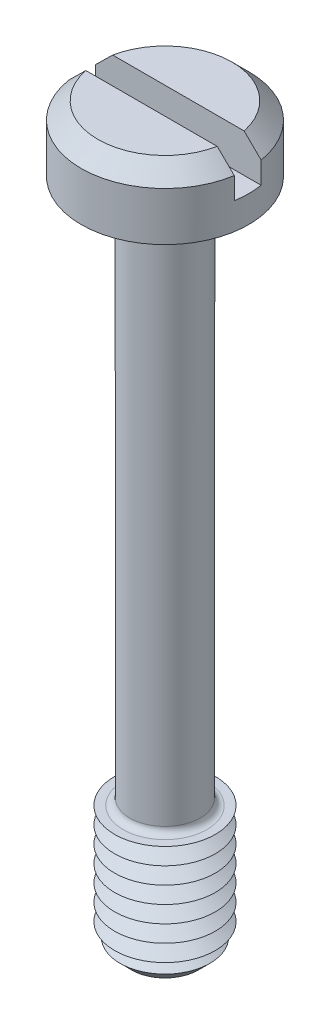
ISO-10303-21;
HEADER;
FILE_DESCRIPTION(('STEP AP214'),'2;1');
FILE_NAME('part.step','',(''),(''),'','','');
FILE_SCHEMA(('AUTOMOTIVE_DESIGN { 1 0 10303 214 1 1 1 1 }'));
ENDSEC;
DATA;
#1=APPLICATION_CONTEXT('core data for automotive mechanical design processes');
#2=APPLICATION_PROTOCOL_DEFINITION('international standard','automotive_design',2000,#1);
#3=PRODUCT_CONTEXT('',#1,'mechanical');
#4=PRODUCT('Part','Part','',(#3));
#5=PRODUCT_RELATED_PRODUCT_CATEGORY('part','',(#4));
#6=PRODUCT_DEFINITION_FORMATION('','',#4);
#7=PRODUCT_DEFINITION_CONTEXT('part definition',#1,'design');
#8=PRODUCT_DEFINITION('design','',#6,#7);
#9=PRODUCT_DEFINITION_SHAPE('','',#8);
#10=(LENGTH_UNIT() NAMED_UNIT(*) SI_UNIT(.MILLI.,.METRE.));
#11=(NAMED_UNIT(*) PLANE_ANGLE_UNIT() SI_UNIT($,.RADIAN.));
#12=(NAMED_UNIT(*) SI_UNIT($,.STERADIAN.) SOLID_ANGLE_UNIT());
#13=UNCERTAINTY_MEASURE_WITH_UNIT(LENGTH_MEASURE(1.E-05),#10,'distance_accuracy_value','');
#14=(GEOMETRIC_REPRESENTATION_CONTEXT(3) GLOBAL_UNCERTAINTY_ASSIGNED_CONTEXT((#13)) GLOBAL_UNIT_ASSIGNED_CONTEXT((#10,
#11,#12)) REPRESENTATION_CONTEXT('',''));
#15=CARTESIAN_POINT('',(0.,0.,0.));
#16=DIRECTION('',(0.,0.,1.));
#17=DIRECTION('',(1.,0.,0.));
#18=AXIS2_PLACEMENT_3D('',#15,#16,#17);
#19=CARTESIAN_POINT('',(0.,3.9,0.));
#20=DIRECTION('',(0.,1.,0.));
#21=DIRECTION('',(0.,0.,1.));
#22=AXIS2_PLACEMENT_3D('',#19,#20,#21);
#23=PLANE('',#22);
#24=DIRECTION('',(-1.,0.,0.));
#25=VECTOR('',#24,1.);
#26=CARTESIAN_POINT('',(5.,3.9,-0.8));
#27=LINE('',#26,#25);
#28=CARTESIAN_POINT('',(3.91918358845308,3.9,-0.8));
#29=VERTEX_POINT('',#28);
#30=CARTESIAN_POINT('',(-3.91918358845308,3.9,-0.8));
#31=VERTEX_POINT('',#30);
#32=EDGE_CURVE('E110',#29,#31,#27,.T.);
#33=ORIENTED_EDGE('',*,*,#32,.F.);
#34=CARTESIAN_POINT('',(0.,3.9,0.));
#35=DIRECTION('',(0.,1.,0.));
#36=DIRECTION('',(0.,0.,1.));
#37=AXIS2_PLACEMENT_3D('',#34,#35,#36);
#38=CIRCLE('',#37,4.);
#39=EDGE_CURVE('E113',#29,#31,#38,.T.);
#40=ORIENTED_EDGE('',*,*,#39,.T.);
#41=EDGE_LOOP('',(#33,#40));
#42=FACE_BOUND('',#41,.T.);
#43=ADVANCED_FACE('F39',(#42),#23,.T.);
#44=CARTESIAN_POINT('',(0.,3.9,0.));
#45=DIRECTION('',(0.,-1.,0.));
#46=DIRECTION('',(0.,0.,-1.));
#47=AXIS2_PLACEMENT_3D('',#44,#45,#46);
#48=CONICAL_SURFACE('',#47,4.,0.785398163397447);
#49=CARTESIAN_POINT('',(11.0010756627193,-3.13012537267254,-0.8));
#50=CARTESIAN_POINT('',(10.6180645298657,-2.74813121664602,-0.8));
#51=CARTESIAN_POINT('',(10.2350087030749,-2.36618183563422,-0.8));
#52=CARTESIAN_POINT('',(9.46873746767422,-1.60241986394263,-0.8));
#53=CARTESIAN_POINT('',(9.08552205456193,-1.2206072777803,-0.8));
#54=CARTESIAN_POINT('',(8.31861292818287,-0.456918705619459,-0.8));
#55=CARTESIAN_POINT('',(7.93491906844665,-0.0750428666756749,-0.8));
#56=CARTESIAN_POINT('',(7.16722555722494,0.688378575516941,-0.8));
#57=CARTESIAN_POINT('',(6.78322591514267,1.06992418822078,-0.8));
#58=CARTESIAN_POINT('',(6.01856215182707,1.82868912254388,-0.8));
#59=CARTESIAN_POINT('',(5.63790309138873,2.20591354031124,-0.8));
#60=CARTESIAN_POINT('',(5.06622054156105,2.77108317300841,-0.8));
#61=CARTESIAN_POINT('',(4.87553531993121,2.9593704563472,-0.8));
#62=CARTESIAN_POINT('',(4.49384424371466,3.33561647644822,-0.8));
#63=CARTESIAN_POINT('',(4.302838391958,3.52357521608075,-0.8));
#64=CARTESIAN_POINT('',(3.92044271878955,3.89893397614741,-0.8));
#65=CARTESIAN_POINT('',(3.7290531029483,4.08633420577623,-0.8));
#66=CARTESIAN_POINT('',(3.34554223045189,4.46039762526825,-0.8));
#67=CARTESIAN_POINT('',(3.15342094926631,4.64706078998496,-0.8));
#68=CARTESIAN_POINT('',(2.76802565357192,5.01913697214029,-0.8));
#69=CARTESIAN_POINT('',(2.57475182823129,5.2045501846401,-0.8));
#70=CARTESIAN_POINT('',(2.28318236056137,5.48091108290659,-0.8));
#71=CARTESIAN_POINT('',(2.1857187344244,5.57273577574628,-0.8));
#72=CARTESIAN_POINT('',(1.98998431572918,5.75552004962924,-0.8));
#73=CARTESIAN_POINT('',(1.89171354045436,5.84647964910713,-0.8));
#74=CARTESIAN_POINT('',(1.76578543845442,5.96147491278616,-0.8));
#75=CARTESIAN_POINT('',(1.73869031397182,5.98612635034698,-0.8));
#76=CARTESIAN_POINT('',(1.68439529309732,6.03531372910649,-0.8));
#77=CARTESIAN_POINT('',(1.65719539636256,6.05984966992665,-0.8));
#78=CARTESIAN_POINT('',(1.5754162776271,6.13326356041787,-0.8));
#79=CARTESIAN_POINT('',(1.52066027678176,6.18194515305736,-0.8));
#80=CARTESIAN_POINT('',(1.41038257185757,6.27874171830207,-0.8));
#81=CARTESIAN_POINT('',(1.35485918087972,6.32685477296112,-0.8));
#82=CARTESIAN_POINT('',(1.24299231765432,6.42210730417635,-0.8));
#83=CARTESIAN_POINT('',(1.18664895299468,6.46924690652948,-0.8));
#84=CARTESIAN_POINT('',(1.07845249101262,6.55754663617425,-0.8));
#85=CARTESIAN_POINT('',(1.02670624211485,6.59883713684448,-0.8));
#86=CARTESIAN_POINT('',(0.921961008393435,6.67979338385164,-0.8));
#87=CARTESIAN_POINT('',(0.868962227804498,6.71945939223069,-0.8));
#88=CARTESIAN_POINT('',(0.761295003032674,6.79630361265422,-0.8));
#89=CARTESIAN_POINT('',(0.706629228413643,6.83348552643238,-0.8));
#90=CARTESIAN_POINT('',(0.594896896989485,6.90399895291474,-0.8));
#91=CARTESIAN_POINT('',(0.537833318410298,6.9373350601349,-0.8));
#92=CARTESIAN_POINT('',(0.428390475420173,6.99356340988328,-0.8));
#93=CARTESIAN_POINT('',(0.376435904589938,7.01726022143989,-0.8));
#94=CARTESIAN_POINT('',(0.269759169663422,7.05717670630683,-0.8));
#95=CARTESIAN_POINT('',(0.21504674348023,7.07342088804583,-0.8));
#96=CARTESIAN_POINT('',(0.113016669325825,7.09332110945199,-0.8));
#97=CARTESIAN_POINT('',(0.0660435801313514,7.09866042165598,-0.8));
#98=CARTESIAN_POINT('',(-0.0280587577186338,7.10088875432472,-0.8));
#99=CARTESIAN_POINT('',(-0.075187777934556,7.09778705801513,-0.8));
#100=CARTESIAN_POINT('',(-0.180723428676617,7.08192474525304,-0.8));
#101=CARTESIAN_POINT('',(-0.238762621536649,7.06679554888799,-0.8));
#102=CARTESIAN_POINT('',(-0.323499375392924,7.03748409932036,-0.8));
#103=CARTESIAN_POINT('',(-0.351441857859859,7.02656594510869,-0.8));
#104=CARTESIAN_POINT('',(-0.406569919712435,7.00295901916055,-0.8));
#105=CARTESIAN_POINT('',(-0.433755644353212,6.99027059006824,-0.8));
#106=CARTESIAN_POINT('',(-0.504673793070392,6.95489235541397,-0.8));
#107=CARTESIAN_POINT('',(-0.547808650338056,6.93101671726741,-0.8));
#108=CARTESIAN_POINT('',(-0.632566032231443,6.88069648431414,-0.8));
#109=CARTESIAN_POINT('',(-0.674187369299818,6.85424992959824,-0.8));
#110=CARTESIAN_POINT('',(-0.756326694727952,6.79950439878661,-0.8));
#111=CARTESIAN_POINT('',(-0.796841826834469,6.77120117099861,-0.8));
#112=CARTESIAN_POINT('',(-0.876938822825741,6.71329852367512,-0.8));
#113=CARTESIAN_POINT('',(-0.916520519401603,6.68369887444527,-0.8));
#114=CARTESIAN_POINT('',(-1.03465904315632,6.59312324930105,-0.8));
#115=CARTESIAN_POINT('',(-1.11211338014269,6.53071425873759,-0.8));
#116=CARTESIAN_POINT('',(-1.26505454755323,6.40381418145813,-0.8));
#117=CARTESIAN_POINT('',(-1.34054439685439,6.33932667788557,-0.8));
#118=CARTESIAN_POINT('',(-1.48913173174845,6.20997083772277,-0.8));
#119=CARTESIAN_POINT('',(-1.56224816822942,6.14512422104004,-0.8));
#120=CARTESIAN_POINT('',(-1.70765393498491,6.01451044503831,-0.8));
#121=CARTESIAN_POINT('',(-1.77994324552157,5.94874326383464,-0.8));
#122=CARTESIAN_POINT('',(-1.99594639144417,5.75046596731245,-0.8));
#123=CARTESIAN_POINT('',(-2.13877767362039,5.6169958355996,-0.8));
#124=CARTESIAN_POINT('',(-2.42324632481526,5.34853800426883,-0.8));
#125=CARTESIAN_POINT('',(-2.56488247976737,5.2135490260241,-0.8));
#126=CARTESIAN_POINT('',(-2.84730929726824,4.94270932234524,-0.8));
#127=CARTESIAN_POINT('',(-2.98810001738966,4.80685865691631,-0.8));
#128=CARTESIAN_POINT('',(-3.26818763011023,4.53549974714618,-0.8));
#129=CARTESIAN_POINT('',(-3.40748821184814,4.39999530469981,-0.8));
#130=CARTESIAN_POINT('',(-3.68570899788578,4.12859172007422,-0.8));
#131=CARTESIAN_POINT('',(-3.82462919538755,3.99269257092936,-0.8));
#132=CARTESIAN_POINT('',(-4.24087543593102,3.58468153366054,-0.8));
#133=CARTESIAN_POINT('',(-4.51779300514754,3.31215310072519,-0.8));
#134=CARTESIAN_POINT('',(-5.05279381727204,2.7844393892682,-0.8));
#135=CARTESIAN_POINT('',(-5.31091639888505,2.52929393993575,-0.8));
#136=CARTESIAN_POINT('',(-5.82680751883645,2.01864429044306,-0.8));
#137=CARTESIAN_POINT('',(-6.08457605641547,1.76314008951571,-0.8));
#138=CARTESIAN_POINT('',(-6.85760508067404,0.996194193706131,-0.8));
#139=CARTESIAN_POINT('',(-7.37251152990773,0.48439576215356,-0.8));
#140=CARTESIAN_POINT('',(-8.40657233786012,-0.544392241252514,-0.8));
#141=CARTESIAN_POINT('',(-8.92572224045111,-1.06138628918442,-0.8));
#142=CARTESIAN_POINT('',(-9.96362871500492,-2.09560660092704,-0.8));
#143=CARTESIAN_POINT('',(-10.4823853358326,-2.61283281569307,-0.8));
#144=CARTESIAN_POINT('',(-11.0010756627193,-3.13012537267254,-0.8));
#145=B_SPLINE_CURVE_WITH_KNOTS('',3,(#49,#50,#51,#52,#53,#54,#55,#56,#57,#58,#59,#60,#61,#62,
#63,#64,#65,#66,#67,#68,#69,#70,#71,#72,#73,#74,#75,#76,#77,#78,#79,#80,#81,#82,#83,#84,#85,#86,
#87,#88,#89,#90,#91,#92,#93,#94,#95,#96,#97,#98,#99,#100,#101,#102,#103,#104,#105,#106,#107,
#108,#109,#110,#111,#112,#113,#114,#115,#116,#117,#118,#119,#120,#121,#122,#123,#124,#125,#126,
#127,#128,#129,#130,#131,#132,#133,#134,#135,#136,#137,#138,#139,#140,#141,#142,#143,#144),
.UNSPECIFIED.,.F.,.F.,(4,2,2,2,2,2,2,2,2,2,2,2,2,2,2,2,2,2,2,2,2,2,2,2,2,2,2,2,2,2,2,2,2,2,2,2,
2,2,2,2,2,2,2,2,2,2,2,4),(0.,1.62282275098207,3.24569489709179,4.86971791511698,
6.49369278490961,8.10142191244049,8.90535980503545,9.70929063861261,10.5128682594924,
11.3164730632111,12.1199494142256,12.5216659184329,12.9233738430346,13.0332669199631,
13.1431603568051,13.3629580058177,13.5833578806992,13.8037290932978,14.0023112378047,
14.2008612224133,14.3991084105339,14.5971162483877,14.7680800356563,14.9384774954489,
15.0795987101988,15.2205647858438,15.3993585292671,15.4893211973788,15.5792664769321,
15.727032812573,15.8749126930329,16.0231439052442,16.1714014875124,16.4697244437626,
16.7675580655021,17.0607348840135,17.3539186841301,17.9403574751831,18.5273336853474,
19.1142694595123,19.6972736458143,20.280288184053,21.4458742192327,22.5346981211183,
23.6235243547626,25.8015035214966,27.9995014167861,30.1971550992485),.UNSPECIFIED.);
#146=CARTESIAN_POINT('',(4.93558507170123,2.89999999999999,-0.8));
#147=VERTEX_POINT('',#146);
#148=EDGE_CURVE('E252',#147,#29,#145,.T.);
#149=ORIENTED_EDGE('',*,*,#148,.F.);
#150=CARTESIAN_POINT('',(0.,2.89999999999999,0.));
#151=DIRECTION('',(0.,1.,0.));
#152=DIRECTION('',(0.,0.,1.));
#153=AXIS2_PLACEMENT_3D('',#150,#151,#152);
#154=CIRCLE('',#153,5.);
#155=CARTESIAN_POINT('',(-4.93558507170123,2.89999999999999,-0.8));
#156=VERTEX_POINT('',#155);
#157=EDGE_CURVE('E128',#156,#147,#154,.F.);
#158=ORIENTED_EDGE('',*,*,#157,.F.);
#159=EDGE_CURVE('E102',#31,#156,#145,.T.);
#160=ORIENTED_EDGE('',*,*,#159,.F.);
#161=ORIENTED_EDGE('',*,*,#39,.F.);
#162=EDGE_LOOP('',(#149,#158,#160,#161));
#163=FACE_BOUND('',#162,.T.);
#164=ADVANCED_FACE('F214',(#163),#48,.T.);
#165=CARTESIAN_POINT('',(0.,-40.,0.));
#166=DIRECTION('',(0.,1.,0.));
#167=DIRECTION('',(0.,0.,1.));
#168=AXIS2_PLACEMENT_3D('',#165,#166,#167);
#169=CYLINDRICAL_SURFACE('',#168,2.1);
#170=CARTESIAN_POINT('',(0.,-32.1,0.));
#171=DIRECTION('',(0.,-1.,0.));
#172=DIRECTION('',(0.,0.,-1.));
#173=AXIS2_PLACEMENT_3D('',#170,#171,#172);
#174=CIRCLE('',#173,2.1);
#175=CARTESIAN_POINT('',(0.,-32.1,-2.1));
#176=VERTEX_POINT('',#175);
#177=EDGE_CURVE('E123',#176,#176,#174,.F.);
#178=ORIENTED_EDGE('',*,*,#177,.T.);
#179=EDGE_LOOP('',(#178));
#180=FACE_BOUND('',#179,.T.);
#181=CARTESIAN_POINT('',(0.,-0.399999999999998,0.));
#182=DIRECTION('',(0.,1.,0.));
#183=DIRECTION('',(0.,0.,1.));
#184=AXIS2_PLACEMENT_3D('',#181,#182,#183);
#185=CIRCLE('',#184,2.1);
#186=CARTESIAN_POINT('',(0.,-0.399999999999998,2.1));
#187=VERTEX_POINT('',#186);
#188=EDGE_CURVE('E349',#187,#187,#185,.F.);
#189=ORIENTED_EDGE('',*,*,#188,.T.);
#190=EDGE_LOOP('',(#189));
#191=FACE_BOUND('',#190,.T.);
#192=ADVANCED_FACE('F210',(#180,#191),#169,.T.);
#193=CARTESIAN_POINT('',(0.,3.9,0.));
#194=DIRECTION('',(0.,-1.,0.));
#195=DIRECTION('',(0.,0.,-1.));
#196=AXIS2_PLACEMENT_3D('',#193,#194,#195);
#197=CYLINDRICAL_SURFACE('',#196,5.);
#198=ORIENTED_EDGE('',*,*,#157,.T.);
#199=DIRECTION('',(0.,-1.,0.));
#200=VECTOR('',#199,1.);
#201=CARTESIAN_POINT('',(4.93558507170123,3.9,-0.8));
#202=LINE('',#201,#200);
#203=CARTESIAN_POINT('',(4.93558507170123,1.6,-0.8));
#204=VERTEX_POINT('',#203);
#205=EDGE_CURVE('E64',#147,#204,#202,.T.);
#206=ORIENTED_EDGE('',*,*,#205,.T.);
#207=CARTESIAN_POINT('',(0.,1.6,0.));
#208=DIRECTION('',(0.,1.,0.));
#209=DIRECTION('',(0.,0.,1.));
#210=AXIS2_PLACEMENT_3D('',#207,#208,#209);
#211=CIRCLE('',#210,5.);
#212=CARTESIAN_POINT('',(4.93558507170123,1.6,0.8));
#213=VERTEX_POINT('',#212);
#214=EDGE_CURVE('E11',#213,#204,#211,.T.);
#215=ORIENTED_EDGE('',*,*,#214,.F.);
#216=DIRECTION('',(0.,-1.,0.));
#217=VECTOR('',#216,1.);
#218=CARTESIAN_POINT('',(4.93558507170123,3.9,0.8));
#219=LINE('',#218,#217);
#220=CARTESIAN_POINT('',(4.93558507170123,2.89999999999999,0.8));
#221=VERTEX_POINT('',#220);
#222=EDGE_CURVE('E267',#213,#221,#219,.F.);
#223=ORIENTED_EDGE('',*,*,#222,.T.);
#224=CARTESIAN_POINT('',(-4.93558507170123,2.89999999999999,0.8));
#225=VERTEX_POINT('',#224);
#226=EDGE_CURVE('E120',#221,#225,#154,.F.);
#227=ORIENTED_EDGE('',*,*,#226,.T.);
#228=DIRECTION('',(0.,-1.,0.));
#229=VECTOR('',#228,1.);
#230=CARTESIAN_POINT('',(-4.93558507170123,3.9,0.8));
#231=LINE('',#230,#229);
#232=CARTESIAN_POINT('',(-4.93558507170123,1.6,0.8));
#233=VERTEX_POINT('',#232);
#234=EDGE_CURVE('E96',#225,#233,#231,.T.);
#235=ORIENTED_EDGE('',*,*,#234,.T.);
#236=CARTESIAN_POINT('',(-4.93558507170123,1.6,-0.8));
#237=VERTEX_POINT('',#236);
#238=EDGE_CURVE('E44',#237,#233,#211,.T.);
#239=ORIENTED_EDGE('',*,*,#238,.F.);
#240=DIRECTION('',(0.,-1.,0.));
#241=VECTOR('',#240,1.);
#242=CARTESIAN_POINT('',(-4.93558507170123,3.9,-0.8));
#243=LINE('',#242,#241);
#244=EDGE_CURVE('E272',#237,#156,#243,.F.);
#245=ORIENTED_EDGE('',*,*,#244,.T.);
#246=EDGE_LOOP('',(#198,#206,#215,#223,#227,#235,#239,#245));
#247=FACE_BOUND('',#246,.T.);
#248=CARTESIAN_POINT('',(0.,0.,0.));
#249=DIRECTION('',(0.,1.,0.));
#250=DIRECTION('',(0.,0.,1.));
#251=AXIS2_PLACEMENT_3D('',#248,#249,#250);
#252=CIRCLE('',#251,5.);
#253=CARTESIAN_POINT('',(0.,0.,5.));
#254=VERTEX_POINT('',#253);
#255=EDGE_CURVE('E334',#254,#254,#252,.T.);
#256=ORIENTED_EDGE('',*,*,#255,.T.);
#257=EDGE_LOOP('',(#256));
#258=FACE_BOUND('',#257,.T.);
#259=ADVANCED_FACE('F213',(#247,#258),#197,.T.);
#260=DIRECTION('',(1.,0.,0.));
#261=VECTOR('',#260,1.);
#262=CARTESIAN_POINT('',(5.,3.9,0.8));
#263=LINE('',#262,#261);
#264=CARTESIAN_POINT('',(-3.91918358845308,3.9,0.8));
#265=VERTEX_POINT('',#264);
#266=CARTESIAN_POINT('',(3.91918358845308,3.9,0.8));
#267=VERTEX_POINT('',#266);
#268=EDGE_CURVE('E56',#265,#267,#263,.T.);
#269=ORIENTED_EDGE('',*,*,#268,.F.);
#270=EDGE_CURVE('E108',#265,#267,#38,.T.);
#271=ORIENTED_EDGE('',*,*,#270,.T.);
#272=EDGE_LOOP('',(#269,#271));
#273=FACE_BOUND('',#272,.T.);
#274=ADVANCED_FACE('F107',(#273),#23,.T.);
#275=CARTESIAN_POINT('',(0.,0.,0.));
#276=DIRECTION('',(0.,1.,0.));
#277=DIRECTION('',(0.,0.,1.));
#278=AXIS2_PLACEMENT_3D('',#275,#276,#277);
#279=PLANE('',#278);
#280=CARTESIAN_POINT('',(0.,0.,0.));
#281=DIRECTION('',(0.,1.,0.));
#282=DIRECTION('',(0.,0.,1.));
#283=AXIS2_PLACEMENT_3D('',#280,#281,#282);
#284=CIRCLE('',#283,2.5);
#285=CARTESIAN_POINT('',(0.,0.,2.5));
#286=VERTEX_POINT('',#285);
#287=EDGE_CURVE('E114',#286,#286,#284,.T.);
#288=ORIENTED_EDGE('',*,*,#287,.T.);
#289=EDGE_LOOP('',(#288));
#290=FACE_BOUND('',#289,.T.);
#291=ORIENTED_EDGE('',*,*,#255,.F.);
#292=EDGE_LOOP('',(#291));
#293=FACE_BOUND('',#292,.T.);
#294=ADVANCED_FACE('F204',(#290,#293),#279,.F.);
#295=CARTESIAN_POINT('',(0.,-32.5,0.));
#296=DIRECTION('',(0.,-1.,0.));
#297=DIRECTION('',(0.,0.,-1.));
#298=AXIS2_PLACEMENT_3D('',#295,#296,#297);
#299=PLANE('',#298);
#300=CARTESIAN_POINT('',(0.,-32.5,0.));
#301=DIRECTION('',(0.,-1.,0.));
#302=DIRECTION('',(0.,0.,-1.));
#303=AXIS2_PLACEMENT_3D('',#300,#301,#302);
#304=CIRCLE('',#303,2.5);
#305=CARTESIAN_POINT('',(0.,-32.5,-2.5));
#306=VERTEX_POINT('',#305);
#307=EDGE_CURVE('E342',#306,#306,#304,.T.);
#308=ORIENTED_EDGE('',*,*,#307,.T.);
#309=EDGE_LOOP('',(#308));
#310=FACE_BOUND('',#309,.T.);
#311=CARTESIAN_POINT('',(0.,-32.5,0.));
#312=DIRECTION('',(0.,1.,0.));
#313=DIRECTION('',(0.,0.,1.));
#314=AXIS2_PLACEMENT_3D('',#311,#312,#313);
#315=CIRCLE('',#314,3.);
#316=CARTESIAN_POINT('',(0.,-32.5,3.));
#317=VERTEX_POINT('',#316);
#318=EDGE_CURVE('E330',#317,#317,#315,.T.);
#319=ORIENTED_EDGE('',*,*,#318,.T.);
#320=EDGE_LOOP('',(#319));
#321=FACE_BOUND('',#320,.T.);
#322=ADVANCED_FACE('F200',(#310,#321),#299,.F.);
#323=CARTESIAN_POINT('',(0.,-33.,0.));
#324=DIRECTION('',(0.,1.,0.));
#325=DIRECTION('',(0.,0.,1.));
#326=AXIS2_PLACEMENT_3D('',#323,#324,#325);
#327=CONICAL_SURFACE('',#326,2.13397459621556,1.0471975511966);
#328=ORIENTED_EDGE('',*,*,#318,.F.);
#329=EDGE_LOOP('',(#328));
#330=FACE_BOUND('',#329,.T.);
#331=CARTESIAN_POINT('',(0.,-33.,0.));
#332=DIRECTION('',(0.,1.,0.));
#333=DIRECTION('',(0.,0.,1.));
#334=AXIS2_PLACEMENT_3D('',#331,#332,#333);
#335=CIRCLE('',#334,2.13397459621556);
#336=CARTESIAN_POINT('',(0.,-33.,2.13397459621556));
#337=VERTEX_POINT('',#336);
#338=EDGE_CURVE('E326',#337,#337,#335,.T.);
#339=ORIENTED_EDGE('',*,*,#338,.T.);
#340=EDGE_LOOP('',(#339));
#341=FACE_BOUND('',#340,.T.);
#342=ADVANCED_FACE('F196',(#330,#341),#327,.T.);
#343=CARTESIAN_POINT('',(0.,-33.5,0.));
#344=DIRECTION('',(0.,-1.,0.));
#345=DIRECTION('',(0.,0.,-1.));
#346=AXIS2_PLACEMENT_3D('',#343,#344,#345);
#347=CONICAL_SURFACE('',#346,3.,1.0471975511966);
#348=ORIENTED_EDGE('',*,*,#338,.F.);
#349=EDGE_LOOP('',(#348));
#350=FACE_BOUND('',#349,.T.);
#351=CARTESIAN_POINT('',(0.,-33.5,0.));
#352=DIRECTION('',(0.,1.,0.));
#353=DIRECTION('',(0.,0.,1.));
#354=AXIS2_PLACEMENT_3D('',#351,#352,#353);
#355=CIRCLE('',#354,3.);
#356=CARTESIAN_POINT('',(0.,-33.5,3.));
#357=VERTEX_POINT('',#356);
#358=EDGE_CURVE('E322',#357,#357,#355,.T.);
#359=ORIENTED_EDGE('',*,*,#358,.T.);
#360=EDGE_LOOP('',(#359));
#361=FACE_BOUND('',#360,.T.);
#362=ADVANCED_FACE('F192',(#350,#361),#347,.T.);
#363=CARTESIAN_POINT('',(0.,-34.,0.));
#364=DIRECTION('',(0.,1.,0.));
#365=DIRECTION('',(0.,0.,1.));
#366=AXIS2_PLACEMENT_3D('',#363,#364,#365);
#367=CONICAL_SURFACE('',#366,2.13397459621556,1.0471975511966);
#368=ORIENTED_EDGE('',*,*,#358,.F.);
#369=EDGE_LOOP('',(#368));
#370=FACE_BOUND('',#369,.T.);
#371=CARTESIAN_POINT('',(0.,-34.,0.));
#372=DIRECTION('',(0.,1.,0.));
#373=DIRECTION('',(0.,0.,1.));
#374=AXIS2_PLACEMENT_3D('',#371,#372,#373);
#375=CIRCLE('',#374,2.13397459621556);
#376=CARTESIAN_POINT('',(0.,-34.,2.13397459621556));
#377=VERTEX_POINT('',#376);
#378=EDGE_CURVE('E318',#377,#377,#375,.T.);
#379=ORIENTED_EDGE('',*,*,#378,.T.);
#380=EDGE_LOOP('',(#379));
#381=FACE_BOUND('',#380,.T.);
#382=ADVANCED_FACE('F188',(#370,#381),#367,.T.);
#383=CARTESIAN_POINT('',(0.,-34.5,0.));
#384=DIRECTION('',(0.,-1.,0.));
#385=DIRECTION('',(0.,0.,-1.));
#386=AXIS2_PLACEMENT_3D('',#383,#384,#385);
#387=CONICAL_SURFACE('',#386,3.,1.0471975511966);
#388=ORIENTED_EDGE('',*,*,#378,.F.);
#389=EDGE_LOOP('',(#388));
#390=FACE_BOUND('',#389,.T.);
#391=CARTESIAN_POINT('',(0.,-34.5,0.));
#392=DIRECTION('',(0.,1.,0.));
#393=DIRECTION('',(0.,0.,1.));
#394=AXIS2_PLACEMENT_3D('',#391,#392,#393);
#395=CIRCLE('',#394,3.);
#396=CARTESIAN_POINT('',(0.,-34.5,3.));
#397=VERTEX_POINT('',#396);
#398=EDGE_CURVE('E315',#397,#397,#395,.T.);
#399=ORIENTED_EDGE('',*,*,#398,.T.);
#400=EDGE_LOOP('',(#399));
#401=FACE_BOUND('',#400,.T.);
#402=ADVANCED_FACE('F184',(#390,#401),#387,.T.);
#403=CARTESIAN_POINT('',(0.,-35.,0.));
#404=DIRECTION('',(0.,1.,0.));
#405=DIRECTION('',(0.,0.,1.));
#406=AXIS2_PLACEMENT_3D('',#403,#404,#405);
#407=CONICAL_SURFACE('',#406,2.13397459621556,1.0471975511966);
#408=ORIENTED_EDGE('',*,*,#398,.F.);
#409=EDGE_LOOP('',(#408));
#410=FACE_BOUND('',#409,.T.);
#411=CARTESIAN_POINT('',(0.,-35.,0.));
#412=DIRECTION('',(0.,1.,0.));
#413=DIRECTION('',(0.,0.,1.));
#414=AXIS2_PLACEMENT_3D('',#411,#412,#413);
#415=CIRCLE('',#414,2.13397459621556);
#416=CARTESIAN_POINT('',(0.,-35.,2.13397459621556));
#417=VERTEX_POINT('',#416);
#418=EDGE_CURVE('E312',#417,#417,#415,.T.);
#419=ORIENTED_EDGE('',*,*,#418,.T.);
#420=EDGE_LOOP('',(#419));
#421=FACE_BOUND('',#420,.T.);
#422=ADVANCED_FACE('F180',(#410,#421),#407,.T.);
#423=CARTESIAN_POINT('',(0.,-35.5,0.));
#424=DIRECTION('',(0.,-1.,0.));
#425=DIRECTION('',(0.,0.,-1.));
#426=AXIS2_PLACEMENT_3D('',#423,#424,#425);
#427=CONICAL_SURFACE('',#426,3.,1.0471975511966);
#428=ORIENTED_EDGE('',*,*,#418,.F.);
#429=EDGE_LOOP('',(#428));
#430=FACE_BOUND('',#429,.T.);
#431=CARTESIAN_POINT('',(0.,-35.5,0.));
#432=DIRECTION('',(0.,1.,0.));
#433=DIRECTION('',(0.,0.,1.));
#434=AXIS2_PLACEMENT_3D('',#431,#432,#433);
#435=CIRCLE('',#434,3.);
#436=CARTESIAN_POINT('',(0.,-35.5,3.));
#437=VERTEX_POINT('',#436);
#438=EDGE_CURVE('E308',#437,#437,#435,.T.);
#439=ORIENTED_EDGE('',*,*,#438,.T.);
#440=EDGE_LOOP('',(#439));
#441=FACE_BOUND('',#440,.T.);
#442=ADVANCED_FACE('F176',(#430,#441),#427,.T.);
#443=CARTESIAN_POINT('',(0.,-36.,0.));
#444=DIRECTION('',(0.,1.,0.));
#445=DIRECTION('',(0.,0.,1.));
#446=AXIS2_PLACEMENT_3D('',#443,#444,#445);
#447=CONICAL_SURFACE('',#446,2.13397459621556,1.0471975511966);
#448=ORIENTED_EDGE('',*,*,#438,.F.);
#449=EDGE_LOOP('',(#448));
#450=FACE_BOUND('',#449,.T.);
#451=CARTESIAN_POINT('',(0.,-36.,0.));
#452=DIRECTION('',(0.,1.,0.));
#453=DIRECTION('',(0.,0.,1.));
#454=AXIS2_PLACEMENT_3D('',#451,#452,#453);
#455=CIRCLE('',#454,2.13397459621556);
#456=CARTESIAN_POINT('',(0.,-36.,2.13397459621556));
#457=VERTEX_POINT('',#456);
#458=EDGE_CURVE('E305',#457,#457,#455,.T.);
#459=ORIENTED_EDGE('',*,*,#458,.T.);
#460=EDGE_LOOP('',(#459));
#461=FACE_BOUND('',#460,.T.);
#462=ADVANCED_FACE('F172',(#450,#461),#447,.T.);
#463=CARTESIAN_POINT('',(0.,-36.5,0.));
#464=DIRECTION('',(0.,-1.,0.));
#465=DIRECTION('',(0.,0.,-1.));
#466=AXIS2_PLACEMENT_3D('',#463,#464,#465);
#467=CONICAL_SURFACE('',#466,3.,1.0471975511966);
#468=ORIENTED_EDGE('',*,*,#458,.F.);
#469=EDGE_LOOP('',(#468));
#470=FACE_BOUND('',#469,.T.);
#471=CARTESIAN_POINT('',(0.,-36.5,0.));
#472=DIRECTION('',(0.,1.,0.));
#473=DIRECTION('',(0.,0.,1.));
#474=AXIS2_PLACEMENT_3D('',#471,#472,#473);
#475=CIRCLE('',#474,3.);
#476=CARTESIAN_POINT('',(0.,-36.5,3.));
#477=VERTEX_POINT('',#476);
#478=EDGE_CURVE('E301',#477,#477,#475,.T.);
#479=ORIENTED_EDGE('',*,*,#478,.T.);
#480=EDGE_LOOP('',(#479));
#481=FACE_BOUND('',#480,.T.);
#482=ADVANCED_FACE('F168',(#470,#481),#467,.T.);
#483=CARTESIAN_POINT('',(0.,-37.,0.));
#484=DIRECTION('',(0.,1.,0.));
#485=DIRECTION('',(0.,0.,1.));
#486=AXIS2_PLACEMENT_3D('',#483,#484,#485);
#487=CONICAL_SURFACE('',#486,2.13397459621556,1.0471975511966);
#488=ORIENTED_EDGE('',*,*,#478,.F.);
#489=EDGE_LOOP('',(#488));
#490=FACE_BOUND('',#489,.T.);
#491=CARTESIAN_POINT('',(0.,-37.,0.));
#492=DIRECTION('',(0.,1.,0.));
#493=DIRECTION('',(0.,0.,1.));
#494=AXIS2_PLACEMENT_3D('',#491,#492,#493);
#495=CIRCLE('',#494,2.13397459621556);
#496=CARTESIAN_POINT('',(0.,-37.,2.13397459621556));
#497=VERTEX_POINT('',#496);
#498=EDGE_CURVE('E297',#497,#497,#495,.T.);
#499=ORIENTED_EDGE('',*,*,#498,.T.);
#500=EDGE_LOOP('',(#499));
#501=FACE_BOUND('',#500,.T.);
#502=ADVANCED_FACE('F164',(#490,#501),#487,.T.);
#503=CARTESIAN_POINT('',(0.,-37.5,0.));
#504=DIRECTION('',(0.,-1.,0.));
#505=DIRECTION('',(0.,0.,-1.));
#506=AXIS2_PLACEMENT_3D('',#503,#504,#505);
#507=CONICAL_SURFACE('',#506,3.,1.0471975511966);
#508=ORIENTED_EDGE('',*,*,#498,.F.);
#509=EDGE_LOOP('',(#508));
#510=FACE_BOUND('',#509,.T.);
#511=CARTESIAN_POINT('',(0.,-37.5,0.));
#512=DIRECTION('',(0.,1.,0.));
#513=DIRECTION('',(0.,0.,1.));
#514=AXIS2_PLACEMENT_3D('',#511,#512,#513);
#515=CIRCLE('',#514,3.);
#516=CARTESIAN_POINT('',(0.,-37.5,3.));
#517=VERTEX_POINT('',#516);
#518=EDGE_CURVE('E294',#517,#517,#515,.T.);
#519=ORIENTED_EDGE('',*,*,#518,.T.);
#520=EDGE_LOOP('',(#519));
#521=FACE_BOUND('',#520,.T.);
#522=ADVANCED_FACE('F160',(#510,#521),#507,.T.);
#523=CARTESIAN_POINT('',(0.,-38.,0.));
#524=DIRECTION('',(0.,1.,0.));
#525=DIRECTION('',(0.,0.,1.));
#526=AXIS2_PLACEMENT_3D('',#523,#524,#525);
#527=CONICAL_SURFACE('',#526,2.13397459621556,1.0471975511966);
#528=ORIENTED_EDGE('',*,*,#518,.F.);
#529=EDGE_LOOP('',(#528));
#530=FACE_BOUND('',#529,.T.);
#531=CARTESIAN_POINT('',(0.,-38.,0.));
#532=DIRECTION('',(0.,1.,0.));
#533=DIRECTION('',(0.,0.,1.));
#534=AXIS2_PLACEMENT_3D('',#531,#532,#533);
#535=CIRCLE('',#534,2.13397459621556);
#536=CARTESIAN_POINT('',(0.,-38.,2.13397459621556));
#537=VERTEX_POINT('',#536);
#538=EDGE_CURVE('E290',#537,#537,#535,.T.);
#539=ORIENTED_EDGE('',*,*,#538,.T.);
#540=EDGE_LOOP('',(#539));
#541=FACE_BOUND('',#540,.T.);
#542=ADVANCED_FACE('F156',(#530,#541),#527,.T.);
#543=CARTESIAN_POINT('',(0.,-38.5,0.));
#544=DIRECTION('',(0.,-1.,0.));
#545=DIRECTION('',(0.,0.,-1.));
#546=AXIS2_PLACEMENT_3D('',#543,#544,#545);
#547=CONICAL_SURFACE('',#546,3.,1.0471975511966);
#548=ORIENTED_EDGE('',*,*,#538,.F.);
#549=EDGE_LOOP('',(#548));
#550=FACE_BOUND('',#549,.T.);
#551=CARTESIAN_POINT('',(0.,-38.5,0.));
#552=DIRECTION('',(0.,1.,0.));
#553=DIRECTION('',(0.,0.,1.));
#554=AXIS2_PLACEMENT_3D('',#551,#552,#553);
#555=CIRCLE('',#554,3.);
#556=CARTESIAN_POINT('',(0.,-38.5,3.));
#557=VERTEX_POINT('',#556);
#558=EDGE_CURVE('E285',#557,#557,#555,.T.);
#559=ORIENTED_EDGE('',*,*,#558,.T.);
#560=EDGE_LOOP('',(#559));
#561=FACE_BOUND('',#560,.T.);
#562=ADVANCED_FACE('F152',(#550,#561),#547,.T.);
#563=CARTESIAN_POINT('',(0.,-39.,0.));
#564=DIRECTION('',(0.,1.,0.));
#565=DIRECTION('',(0.,0.,1.));
#566=AXIS2_PLACEMENT_3D('',#563,#564,#565);
#567=CONICAL_SURFACE('',#566,2.13397459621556,1.0471975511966);
#568=ORIENTED_EDGE('',*,*,#558,.F.);
#569=EDGE_LOOP('',(#568));
#570=FACE_BOUND('',#569,.T.);
#571=CARTESIAN_POINT('',(0.,-39.,0.));
#572=DIRECTION('',(0.,1.,0.));
#573=DIRECTION('',(0.,0.,1.));
#574=AXIS2_PLACEMENT_3D('',#571,#572,#573);
#575=CIRCLE('',#574,2.13397459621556);
#576=CARTESIAN_POINT('',(0.,-39.,2.13397459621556));
#577=VERTEX_POINT('',#576);
#578=EDGE_CURVE('E281',#577,#577,#575,.T.);
#579=ORIENTED_EDGE('',*,*,#578,.T.);
#580=EDGE_LOOP('',(#579));
#581=FACE_BOUND('',#580,.T.);
#582=ADVANCED_FACE('F148',(#570,#581),#567,.T.);
#583=CARTESIAN_POINT('',(0.,-39.5,0.));
#584=DIRECTION('',(0.,-1.,0.));
#585=DIRECTION('',(0.,0.,-1.));
#586=AXIS2_PLACEMENT_3D('',#583,#584,#585);
#587=CONICAL_SURFACE('',#586,3.,1.0471975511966);
#588=CARTESIAN_POINT('',(0.,-39.3169872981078,0.));
#589=DIRECTION('',(0.,-1.,0.));
#590=DIRECTION('',(0.,0.,-1.));
#591=AXIS2_PLACEMENT_3D('',#588,#589,#590);
#592=CIRCLE('',#591,2.68301270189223);
#593=CARTESIAN_POINT('',(0.,-39.3169872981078,-2.68301270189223));
#594=VERTEX_POINT('',#593);
#595=EDGE_CURVE('E289',#594,#594,#592,.F.);
#596=ORIENTED_EDGE('',*,*,#595,.T.);
#597=EDGE_LOOP('',(#596));
#598=FACE_BOUND('',#597,.T.);
#599=ORIENTED_EDGE('',*,*,#578,.F.);
#600=EDGE_LOOP('',(#599));
#601=FACE_BOUND('',#600,.T.);
#602=ADVANCED_FACE('F144',(#598,#601),#587,.T.);
#603=CARTESIAN_POINT('',(0.,-40.,0.));
#604=DIRECTION('',(0.,-1.,0.));
#605=DIRECTION('',(0.,0.,-1.));
#606=AXIS2_PLACEMENT_3D('',#603,#604,#605);
#607=PLANE('',#606);
#608=CARTESIAN_POINT('',(0.,-40.,0.));
#609=DIRECTION('',(0.,-1.,0.));
#610=DIRECTION('',(0.,0.,-1.));
#611=AXIS2_PLACEMENT_3D('',#608,#609,#610);
#612=CIRCLE('',#611,2.00000000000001);
#613=CARTESIAN_POINT('',(0.,-40.,-2.00000000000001));
#614=VERTEX_POINT('',#613);
#615=EDGE_CURVE('E338',#614,#614,#612,.T.);
#616=ORIENTED_EDGE('',*,*,#615,.T.);
#617=EDGE_LOOP('',(#616));
#618=FACE_BOUND('',#617,.T.);
#619=ADVANCED_FACE('F147',(#618),#607,.T.);
#620=CARTESIAN_POINT('',(0.,-40.,0.));
#621=DIRECTION('',(0.,1.,0.));
#622=DIRECTION('',(0.,0.,1.));
#623=AXIS2_PLACEMENT_3D('',#620,#621,#622);
#624=CONICAL_SURFACE('',#623,2.00000000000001,0.785398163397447);
#625=ORIENTED_EDGE('',*,*,#595,.F.);
#626=EDGE_LOOP('',(#625));
#627=FACE_BOUND('',#626,.T.);
#628=ORIENTED_EDGE('',*,*,#615,.F.);
#629=EDGE_LOOP('',(#628));
#630=FACE_BOUND('',#629,.T.);
#631=ADVANCED_FACE('F208',(#627,#630),#624,.T.);
#632=CARTESIAN_POINT('',(0.,-32.1,0.));
#633=DIRECTION('',(0.,-1.,0.));
#634=DIRECTION('',(0.,0.,-1.));
#635=AXIS2_PLACEMENT_3D('',#632,#633,#634);
#636=TOROIDAL_SURFACE('',#635,2.5,0.4);
#637=ORIENTED_EDGE('',*,*,#177,.F.);
#638=EDGE_LOOP('',(#637));
#639=FACE_BOUND('',#638,.T.);
#640=ORIENTED_EDGE('',*,*,#307,.F.);
#641=EDGE_LOOP('',(#640));
#642=FACE_BOUND('',#641,.T.);
#643=ADVANCED_FACE('F226',(#639,#642),#636,.F.);
#644=CARTESIAN_POINT('',(0.,-0.399999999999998,0.));
#645=DIRECTION('',(0.,1.,0.));
#646=DIRECTION('',(0.,0.,1.));
#647=AXIS2_PLACEMENT_3D('',#644,#645,#646);
#648=TOROIDAL_SURFACE('',#647,2.5,0.4);
#649=ORIENTED_EDGE('',*,*,#287,.F.);
#650=EDGE_LOOP('',(#649));
#651=FACE_BOUND('',#650,.T.);
#652=ORIENTED_EDGE('',*,*,#188,.F.);
#653=EDGE_LOOP('',(#652));
#654=FACE_BOUND('',#653,.T.);
#655=ADVANCED_FACE('F229',(#651,#654),#648,.F.);
#656=CARTESIAN_POINT('',(-11.0010756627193,-3.13012537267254,0.8));
#657=CARTESIAN_POINT('',(-10.6180645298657,-2.74813121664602,0.8));
#658=CARTESIAN_POINT('',(-10.2350087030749,-2.36618183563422,0.8));
#659=CARTESIAN_POINT('',(-9.46873746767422,-1.60241986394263,0.8));
#660=CARTESIAN_POINT('',(-9.08552205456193,-1.2206072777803,0.8));
#661=CARTESIAN_POINT('',(-8.31861292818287,-0.456918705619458,0.8));
#662=CARTESIAN_POINT('',(-7.93491906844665,-0.0750428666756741,0.8));
#663=CARTESIAN_POINT('',(-7.16722555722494,0.688378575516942,0.8));
#664=CARTESIAN_POINT('',(-6.78322591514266,1.06992418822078,0.8));
#665=CARTESIAN_POINT('',(-6.01856215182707,1.82868912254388,0.8));
#666=CARTESIAN_POINT('',(-5.63790309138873,2.20591354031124,0.8));
#667=CARTESIAN_POINT('',(-5.06622054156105,2.77108317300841,0.8));
#668=CARTESIAN_POINT('',(-4.87553531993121,2.95937045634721,0.8));
#669=CARTESIAN_POINT('',(-4.49384424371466,3.33561647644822,0.8));
#670=CARTESIAN_POINT('',(-4.302838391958,3.52357521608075,0.8));
#671=CARTESIAN_POINT('',(-3.92044271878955,3.89893397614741,0.8));
#672=CARTESIAN_POINT('',(-3.7290531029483,4.08633420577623,0.8));
#673=CARTESIAN_POINT('',(-3.34554223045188,4.46039762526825,0.8));
#674=CARTESIAN_POINT('',(-3.15342094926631,4.64706078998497,0.8));
#675=CARTESIAN_POINT('',(-2.76802565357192,5.01913697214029,0.8));
#676=CARTESIAN_POINT('',(-2.57475182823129,5.2045501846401,0.8));
#677=CARTESIAN_POINT('',(-2.28318236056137,5.48091108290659,0.8));
#678=CARTESIAN_POINT('',(-2.1857187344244,5.57273577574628,0.8));
#679=CARTESIAN_POINT('',(-1.98998431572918,5.75552004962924,0.8));
#680=CARTESIAN_POINT('',(-1.89171354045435,5.84647964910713,0.8));
#681=CARTESIAN_POINT('',(-1.76578543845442,5.96147491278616,0.8));
#682=CARTESIAN_POINT('',(-1.73869031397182,5.98612635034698,0.8));
#683=CARTESIAN_POINT('',(-1.68439529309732,6.0353137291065,0.8));
#684=CARTESIAN_POINT('',(-1.65719539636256,6.05984966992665,0.8));
#685=CARTESIAN_POINT('',(-1.5754162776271,6.13326356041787,0.8));
#686=CARTESIAN_POINT('',(-1.52066027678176,6.18194515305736,0.8));
#687=CARTESIAN_POINT('',(-1.41038257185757,6.27874171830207,0.8));
#688=CARTESIAN_POINT('',(-1.35485918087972,6.32685477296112,0.8));
#689=CARTESIAN_POINT('',(-1.24299231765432,6.42210730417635,0.8));
#690=CARTESIAN_POINT('',(-1.18664895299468,6.46924690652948,0.8));
#691=CARTESIAN_POINT('',(-1.07845249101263,6.55754663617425,0.8));
#692=CARTESIAN_POINT('',(-1.02670624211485,6.59883713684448,0.8));
#693=CARTESIAN_POINT('',(-0.921961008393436,6.67979338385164,0.8));
#694=CARTESIAN_POINT('',(-0.868962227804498,6.71945939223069,0.8));
#695=CARTESIAN_POINT('',(-0.761295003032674,6.79630361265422,0.8));
#696=CARTESIAN_POINT('',(-0.706629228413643,6.83348552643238,0.8));
#697=CARTESIAN_POINT('',(-0.594896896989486,6.90399895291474,0.8));
#698=CARTESIAN_POINT('',(-0.5378333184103,6.9373350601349,0.8));
#699=CARTESIAN_POINT('',(-0.428390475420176,6.99356340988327,0.8));
#700=CARTESIAN_POINT('',(-0.376435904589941,7.01726022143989,0.8));
#701=CARTESIAN_POINT('',(-0.269759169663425,7.05717670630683,0.8));
#702=CARTESIAN_POINT('',(-0.215046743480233,7.07342088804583,0.8));
#703=CARTESIAN_POINT('',(-0.113016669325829,7.09332110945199,0.8));
#704=CARTESIAN_POINT('',(-0.0660435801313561,7.09866042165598,0.8));
#705=CARTESIAN_POINT('',(0.028058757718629,7.10088875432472,0.8));
#706=CARTESIAN_POINT('',(0.0751877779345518,7.09778705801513,0.8));
#707=CARTESIAN_POINT('',(0.180723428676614,7.08192474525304,0.8));
#708=CARTESIAN_POINT('',(0.238762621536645,7.06679554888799,0.8));
#709=CARTESIAN_POINT('',(0.32349937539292,7.03748409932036,0.8));
#710=CARTESIAN_POINT('',(0.351441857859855,7.02656594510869,0.8));
#711=CARTESIAN_POINT('',(0.40656991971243,7.00295901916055,0.8));
#712=CARTESIAN_POINT('',(0.433755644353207,6.99027059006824,0.8));
#713=CARTESIAN_POINT('',(0.504673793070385,6.95489235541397,0.8));
#714=CARTESIAN_POINT('',(0.547808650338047,6.93101671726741,0.8));
#715=CARTESIAN_POINT('',(0.632566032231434,6.88069648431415,0.8));
#716=CARTESIAN_POINT('',(0.67418736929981,6.85424992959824,0.8));
#717=CARTESIAN_POINT('',(0.756326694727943,6.79950439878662,0.8));
#718=CARTESIAN_POINT('',(0.796841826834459,6.77120117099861,0.8));
#719=CARTESIAN_POINT('',(0.87693882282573,6.71329852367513,0.8));
#720=CARTESIAN_POINT('',(0.916520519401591,6.68369887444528,0.8));
#721=CARTESIAN_POINT('',(1.03465904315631,6.59312324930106,0.8));
#722=CARTESIAN_POINT('',(1.11211338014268,6.5307142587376,0.8));
#723=CARTESIAN_POINT('',(1.26505454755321,6.40381418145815,0.8));
#724=CARTESIAN_POINT('',(1.34054439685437,6.33932667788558,0.8));
#725=CARTESIAN_POINT('',(1.48913173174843,6.20997083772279,0.8));
#726=CARTESIAN_POINT('',(1.5622481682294,6.14512422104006,0.8));
#727=CARTESIAN_POINT('',(1.70765393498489,6.01451044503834,0.8));
#728=CARTESIAN_POINT('',(1.77994324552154,5.94874326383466,0.8));
#729=CARTESIAN_POINT('',(1.99594639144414,5.75046596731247,0.8));
#730=CARTESIAN_POINT('',(2.13877767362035,5.61699583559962,0.8));
#731=CARTESIAN_POINT('',(2.42324632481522,5.34853800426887,0.8));
#732=CARTESIAN_POINT('',(2.56488247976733,5.21354902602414,0.8));
#733=CARTESIAN_POINT('',(2.84730929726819,4.94270932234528,0.8));
#734=CARTESIAN_POINT('',(2.98810001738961,4.80685865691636,0.8));
#735=CARTESIAN_POINT('',(3.26818763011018,4.53549974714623,0.8));
#736=CARTESIAN_POINT('',(3.40748821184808,4.39999530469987,0.8));
#737=CARTESIAN_POINT('',(3.68570899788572,4.12859172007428,0.8));
#738=CARTESIAN_POINT('',(3.82462919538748,3.99269257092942,0.8));
#739=CARTESIAN_POINT('',(4.24087543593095,3.58468153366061,0.8));
#740=CARTESIAN_POINT('',(4.51779300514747,3.31215310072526,0.8));
#741=CARTESIAN_POINT('',(5.05279381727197,2.78443938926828,0.8));
#742=CARTESIAN_POINT('',(5.31091639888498,2.52929393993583,0.8));
#743=CARTESIAN_POINT('',(5.82680751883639,2.01864429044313,0.8));
#744=CARTESIAN_POINT('',(6.08457605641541,1.76314008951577,0.8));
#745=CARTESIAN_POINT('',(6.85760508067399,0.996194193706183,0.8));
#746=CARTESIAN_POINT('',(7.37251152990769,0.484395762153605,0.8));
#747=CARTESIAN_POINT('',(8.40657233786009,-0.544392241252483,0.8));
#748=CARTESIAN_POINT('',(8.92572224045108,-1.06138628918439,0.8));
#749=CARTESIAN_POINT('',(9.9636287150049,-2.09560660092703,0.8));
#750=CARTESIAN_POINT('',(10.4823853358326,-2.61283281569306,0.8));
#751=CARTESIAN_POINT('',(11.0010756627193,-3.13012537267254,0.8));
#752=B_SPLINE_CURVE_WITH_KNOTS('',3,(#656,#657,#658,#659,#660,#661,#662,#663,#664,#665,#666,
#667,#668,#669,#670,#671,#672,#673,#674,#675,#676,#677,#678,#679,#680,#681,#682,#683,#684,#685,
#686,#687,#688,#689,#690,#691,#692,#693,#694,#695,#696,#697,#698,#699,#700,#701,#702,#703,#704,
#705,#706,#707,#708,#709,#710,#711,#712,#713,#714,#715,#716,#717,#718,#719,#720,#721,#722,#723,
#724,#725,#726,#727,#728,#729,#730,#731,#732,#733,#734,#735,#736,#737,#738,#739,#740,#741,#742,
#743,#744,#745,#746,#747,#748,#749,#750,#751),.UNSPECIFIED.,.F.,.F.,(4,2,2,2,2,2,2,2,2,2,2,2,2,
2,2,2,2,2,2,2,2,2,2,2,2,2,2,2,2,2,2,2,2,2,2,2,2,2,2,2,2,2,2,2,2,2,2,4),(0.,1.62282275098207,
3.24569489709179,4.86971791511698,6.49369278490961,8.1014219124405,8.90535980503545,
9.70929063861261,10.5128682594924,11.3164730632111,12.1199494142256,12.5216659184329,
12.9233738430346,13.0332669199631,13.1431603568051,13.3629580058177,13.5833578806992,
13.8037290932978,14.0023112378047,14.2008612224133,14.3991084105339,14.5971162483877,
14.7680800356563,14.9384774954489,15.0795987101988,15.2205647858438,15.3993585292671,
15.4893211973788,15.5792664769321,15.727032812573,15.8749126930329,16.0231439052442,
16.1714014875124,16.4697244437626,16.767558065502,17.0607348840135,17.35391868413,
17.9403574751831,18.5273336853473,19.1142694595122,19.6972736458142,20.2802881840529,
21.4458742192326,22.5346981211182,23.6235243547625,25.8015035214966,27.9995014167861,
30.1971550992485),.UNSPECIFIED.);
#753=EDGE_CURVE('E92',#225,#265,#752,.T.);
#754=ORIENTED_EDGE('',*,*,#753,.F.);
#755=ORIENTED_EDGE('',*,*,#226,.F.);
#756=EDGE_CURVE('E103',#267,#221,#752,.T.);
#757=ORIENTED_EDGE('',*,*,#756,.F.);
#758=ORIENTED_EDGE('',*,*,#270,.F.);
#759=EDGE_LOOP('',(#754,#755,#757,#758));
#760=FACE_BOUND('',#759,.T.);
#761=ADVANCED_FACE('F41',(#760),#48,.T.);
#762=CARTESIAN_POINT('',(0.,1.6,0.));
#763=DIRECTION('',(0.,1.,0.));
#764=DIRECTION('',(0.,0.,1.));
#765=AXIS2_PLACEMENT_3D('',#762,#763,#764);
#766=PLANE('',#765);
#767=DIRECTION('',(1.,0.,0.));
#768=VECTOR('',#767,1.);
#769=CARTESIAN_POINT('',(5.,1.6,0.8));
#770=LINE('',#769,#768);
#771=EDGE_CURVE('E249',#233,#213,#770,.T.);
#772=ORIENTED_EDGE('',*,*,#771,.T.);
#773=ORIENTED_EDGE('',*,*,#214,.T.);
#774=DIRECTION('',(-1.,0.,0.));
#775=VECTOR('',#774,1.);
#776=CARTESIAN_POINT('',(5.,1.6,-0.8));
#777=LINE('',#776,#775);
#778=EDGE_CURVE('E264',#204,#237,#777,.T.);
#779=ORIENTED_EDGE('',*,*,#778,.T.);
#780=ORIENTED_EDGE('',*,*,#238,.T.);
#781=EDGE_LOOP('',(#772,#773,#779,#780));
#782=FACE_BOUND('',#781,.T.);
#783=ADVANCED_FACE('F236',(#782),#766,.T.);
#784=CARTESIAN_POINT('',(5.,1.6,-0.8));
#785=DIRECTION('',(0.,0.,-1.));
#786=DIRECTION('',(-1.,0.,0.));
#787=AXIS2_PLACEMENT_3D('',#784,#785,#786);
#788=PLANE('',#787);
#789=ORIENTED_EDGE('',*,*,#148,.T.);
#790=ORIENTED_EDGE('',*,*,#32,.T.);
#791=ORIENTED_EDGE('',*,*,#159,.T.);
#792=ORIENTED_EDGE('',*,*,#244,.F.);
#793=ORIENTED_EDGE('',*,*,#778,.F.);
#794=ORIENTED_EDGE('',*,*,#205,.F.);
#795=EDGE_LOOP('',(#789,#790,#791,#792,#793,#794));
#796=FACE_BOUND('',#795,.T.);
#797=ADVANCED_FACE('F141',(#796),#788,.F.);
#798=CARTESIAN_POINT('',(5.,1.6,0.8));
#799=DIRECTION('',(0.,0.,1.));
#800=DIRECTION('',(1.,0.,0.));
#801=AXIS2_PLACEMENT_3D('',#798,#799,#800);
#802=PLANE('',#801);
#803=ORIENTED_EDGE('',*,*,#753,.T.);
#804=ORIENTED_EDGE('',*,*,#268,.T.);
#805=ORIENTED_EDGE('',*,*,#756,.T.);
#806=ORIENTED_EDGE('',*,*,#222,.F.);
#807=ORIENTED_EDGE('',*,*,#771,.F.);
#808=ORIENTED_EDGE('',*,*,#234,.F.);
#809=EDGE_LOOP('',(#803,#804,#805,#806,#807,#808));
#810=FACE_BOUND('',#809,.T.);
#811=ADVANCED_FACE('F93',(#810),#802,.F.);
#812=CLOSED_SHELL('',(#43,#164,#192,#259,#274,#294,#322,#342,#362,#382,#402,#422,#442,#462,#482,
#502,#522,#542,#562,#582,#602,#619,#631,#643,#655,#761,#783,#797,#811));
#813=MANIFOLD_SOLID_BREP('B2',#812);
#814=ADVANCED_BREP_SHAPE_REPRESENTATION('',(#18,#813),#14);
#815=SHAPE_DEFINITION_REPRESENTATION(#9,#814);
ENDSEC;
END-ISO-10303-21;
